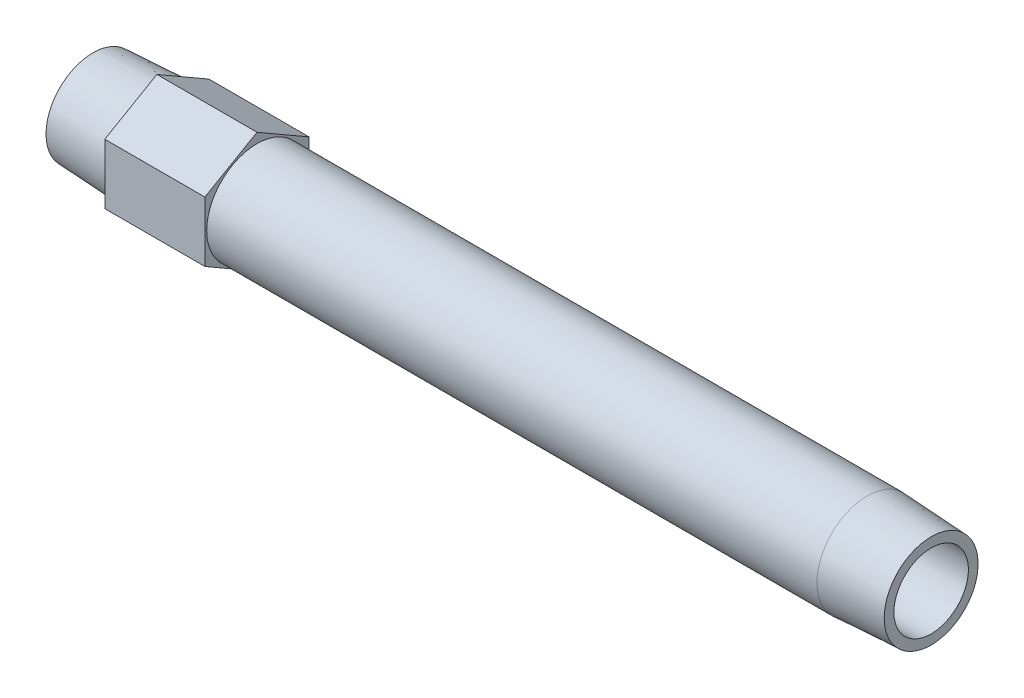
ISO-10303-21;
HEADER;
FILE_DESCRIPTION(('STEP AP214'),'2;1');
FILE_NAME('part.step','',(''),(''),'','','');
FILE_SCHEMA(('AUTOMOTIVE_DESIGN { 1 0 10303 214 1 1 1 1 }'));
ENDSEC;
DATA;
#1=APPLICATION_CONTEXT('core data for automotive mechanical design processes');
#2=APPLICATION_PROTOCOL_DEFINITION('international standard','automotive_design',2000,#1);
#3=PRODUCT_CONTEXT('',#1,'mechanical');
#4=PRODUCT('Part','Part','',(#3));
#5=PRODUCT_RELATED_PRODUCT_CATEGORY('part','',(#4));
#6=PRODUCT_DEFINITION_FORMATION('','',#4);
#7=PRODUCT_DEFINITION_CONTEXT('part definition',#1,'design');
#8=PRODUCT_DEFINITION('design','',#6,#7);
#9=PRODUCT_DEFINITION_SHAPE('','',#8);
#10=(LENGTH_UNIT() NAMED_UNIT(*) SI_UNIT(.MILLI.,.METRE.));
#11=(NAMED_UNIT(*) PLANE_ANGLE_UNIT() SI_UNIT($,.RADIAN.));
#12=(NAMED_UNIT(*) SI_UNIT($,.STERADIAN.) SOLID_ANGLE_UNIT());
#13=UNCERTAINTY_MEASURE_WITH_UNIT(LENGTH_MEASURE(1.E-05),#10,'distance_accuracy_value','');
#14=(GEOMETRIC_REPRESENTATION_CONTEXT(3) GLOBAL_UNCERTAINTY_ASSIGNED_CONTEXT((#13)) GLOBAL_UNIT_ASSIGNED_CONTEXT((#10,
#11,#12)) REPRESENTATION_CONTEXT('',''));
#15=CARTESIAN_POINT('',(0.,0.,0.));
#16=DIRECTION('',(0.,0.,1.));
#17=DIRECTION('',(1.,0.,0.));
#18=AXIS2_PLACEMENT_3D('',#15,#16,#17);
#19=CARTESIAN_POINT('',(0.,0.,-9.95716184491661));
#20=DIRECTION('',(1.,0.,0.));
#21=DIRECTION('',(0.,0.,-1.));
#22=AXIS2_PLACEMENT_3D('',#19,#20,#21);
#23=PLANE('',#22);
#24=CARTESIAN_POINT('',(0.,0.,0.));
#25=DIRECTION('',(-1.,0.,0.));
#26=DIRECTION('',(0.,0.,1.));
#27=AXIS2_PLACEMENT_3D('',#24,#25,#26);
#28=CIRCLE('',#27,9.95716184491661);
#29=CARTESIAN_POINT('',(0.,0.,9.95716184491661));
#30=VERTEX_POINT('',#29);
#31=EDGE_CURVE('E147',#30,#30,#28,.T.);
#32=ORIENTED_EDGE('',*,*,#31,.T.);
#33=EDGE_LOOP('',(#32));
#34=FACE_BOUND('',#33,.T.);
#35=CARTESIAN_POINT('',(0.,0.,0.));
#36=DIRECTION('',(1.,0.,0.));
#37=DIRECTION('',(0.,0.,1.));
#38=AXIS2_PLACEMENT_3D('',#35,#36,#37);
#39=CIRCLE('',#38,7.8994);
#40=CARTESIAN_POINT('',(0.,0.,7.8994));
#41=VERTEX_POINT('',#40);
#42=EDGE_CURVE('E159',#41,#41,#39,.T.);
#43=ORIENTED_EDGE('',*,*,#42,.T.);
#44=EDGE_LOOP('',(#43));
#45=FACE_BOUND('',#44,.T.);
#46=ADVANCED_FACE('F15',(#34,#45),#23,.F.);
#47=CARTESIAN_POINT('',(177.8,0.,-9.95716184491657));
#48=DIRECTION('',(-1.,0.,0.));
#49=DIRECTION('',(0.,0.,1.));
#50=AXIS2_PLACEMENT_3D('',#47,#48,#49);
#51=PLANE('',#50);
#52=CARTESIAN_POINT('',(177.8,0.,0.));
#53=DIRECTION('',(-1.,0.,0.));
#54=DIRECTION('',(0.,0.,1.));
#55=AXIS2_PLACEMENT_3D('',#52,#53,#54);
#56=CIRCLE('',#55,9.95716184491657);
#57=CARTESIAN_POINT('',(177.8,0.,9.95716184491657));
#58=VERTEX_POINT('',#57);
#59=EDGE_CURVE('E150',#58,#58,#56,.T.);
#60=ORIENTED_EDGE('',*,*,#59,.F.);
#61=EDGE_LOOP('',(#60));
#62=FACE_BOUND('',#61,.T.);
#63=CARTESIAN_POINT('',(177.8,0.,0.));
#64=DIRECTION('',(-1.,0.,0.));
#65=DIRECTION('',(0.,0.,1.));
#66=AXIS2_PLACEMENT_3D('',#63,#64,#65);
#67=CIRCLE('',#66,7.8994);
#68=CARTESIAN_POINT('',(177.8,0.,7.8994));
#69=VERTEX_POINT('',#68);
#70=EDGE_CURVE('E156',#69,#69,#67,.F.);
#71=ORIENTED_EDGE('',*,*,#70,.F.);
#72=EDGE_LOOP('',(#71));
#73=FACE_BOUND('',#72,.T.);
#74=ADVANCED_FACE('F178',(#62,#73),#51,.F.);
#75=CARTESIAN_POINT('',(34.798,-6.37914312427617,-11.049));
#76=DIRECTION('',(1.,0.,0.));
#77=DIRECTION('',(0.,1.,0.));
#78=AXIS2_PLACEMENT_3D('',#75,#76,#77);
#79=PLANE('',#78);
#80=DIRECTION('',(0.,0.5,-0.866025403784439));
#81=VECTOR('',#80,1.);
#82=CARTESIAN_POINT('',(34.798,-12.7582862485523,0.));
#83=LINE('',#82,#81);
#84=CARTESIAN_POINT('',(34.798,-12.7582862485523,0.));
#85=VERTEX_POINT('',#84);
#86=CARTESIAN_POINT('',(34.798,-6.37914312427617,-11.049));
#87=VERTEX_POINT('',#86);
#88=EDGE_CURVE('E103',#85,#87,#83,.T.);
#89=ORIENTED_EDGE('',*,*,#88,.T.);
#90=DIRECTION('',(0.,1.,0.));
#91=VECTOR('',#90,1.);
#92=CARTESIAN_POINT('',(34.798,-6.37914312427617,-11.049));
#93=LINE('',#92,#91);
#94=CARTESIAN_POINT('',(34.798,6.37914312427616,-11.049));
#95=VERTEX_POINT('',#94);
#96=EDGE_CURVE('E83',#87,#95,#93,.T.);
#97=ORIENTED_EDGE('',*,*,#96,.T.);
#98=DIRECTION('',(0.,0.5,0.866025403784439));
#99=VECTOR('',#98,1.);
#100=CARTESIAN_POINT('',(34.798,6.37914312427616,-11.049));
#101=LINE('',#100,#99);
#102=CARTESIAN_POINT('',(34.798,12.7582862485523,0.));
#103=VERTEX_POINT('',#102);
#104=EDGE_CURVE('E102',#95,#103,#101,.T.);
#105=ORIENTED_EDGE('',*,*,#104,.T.);
#106=DIRECTION('',(0.,-0.5,0.866025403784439));
#107=VECTOR('',#106,1.);
#108=CARTESIAN_POINT('',(34.798,12.7582862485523,0.));
#109=LINE('',#108,#107);
#110=CARTESIAN_POINT('',(34.798,6.37914312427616,11.049));
#111=VERTEX_POINT('',#110);
#112=EDGE_CURVE('E105',#103,#111,#109,.T.);
#113=ORIENTED_EDGE('',*,*,#112,.T.);
#114=DIRECTION('',(0.,-1.,0.));
#115=VECTOR('',#114,1.);
#116=CARTESIAN_POINT('',(34.798,6.37914312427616,11.049));
#117=LINE('',#116,#115);
#118=CARTESIAN_POINT('',(34.798,-6.37914312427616,11.049));
#119=VERTEX_POINT('',#118);
#120=EDGE_CURVE('E35',#111,#119,#117,.T.);
#121=ORIENTED_EDGE('',*,*,#120,.T.);
#122=DIRECTION('',(0.,-0.5,-0.866025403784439));
#123=VECTOR('',#122,1.);
#124=CARTESIAN_POINT('',(34.798,-6.37914312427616,11.049));
#125=LINE('',#124,#123);
#126=EDGE_CURVE('E30',#119,#85,#125,.T.);
#127=ORIENTED_EDGE('',*,*,#126,.T.);
#128=EDGE_LOOP('',(#89,#97,#105,#113,#121,#127));
#129=FACE_BOUND('',#128,.T.);
#130=CARTESIAN_POINT('',(34.798,0.,0.));
#131=DIRECTION('',(1.,0.,0.));
#132=DIRECTION('',(0.,1.,0.));
#133=AXIS2_PLACEMENT_3D('',#130,#131,#132);
#134=CIRCLE('',#133,10.668);
#135=CARTESIAN_POINT('',(34.798,10.668,0.));
#136=VERTEX_POINT('',#135);
#137=EDGE_CURVE('E89',#136,#136,#134,.F.);
#138=ORIENTED_EDGE('',*,*,#137,.T.);
#139=EDGE_LOOP('',(#138));
#140=FACE_BOUND('',#139,.T.);
#141=ADVANCED_FACE('F124',(#129,#140),#79,.T.);
#142=CARTESIAN_POINT('',(13.5636,-6.37914312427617,-11.049));
#143=DIRECTION('',(1.,0.,0.));
#144=DIRECTION('',(0.,1.,0.));
#145=AXIS2_PLACEMENT_3D('',#142,#143,#144);
#146=PLANE('',#145);
#147=DIRECTION('',(0.,0.5,-0.866025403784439));
#148=VECTOR('',#147,1.);
#149=CARTESIAN_POINT('',(13.5636,-12.7582862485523,0.));
#150=LINE('',#149,#148);
#151=CARTESIAN_POINT('',(13.5636,-12.7582862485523,0.));
#152=VERTEX_POINT('',#151);
#153=CARTESIAN_POINT('',(13.5636,-6.37914312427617,-11.049));
#154=VERTEX_POINT('',#153);
#155=EDGE_CURVE('E73',#152,#154,#150,.T.);
#156=ORIENTED_EDGE('',*,*,#155,.F.);
#157=DIRECTION('',(0.,-0.5,-0.866025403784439));
#158=VECTOR('',#157,1.);
#159=CARTESIAN_POINT('',(13.5636,-6.37914312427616,11.049));
#160=LINE('',#159,#158);
#161=CARTESIAN_POINT('',(13.5636,-6.37914312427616,11.049));
#162=VERTEX_POINT('',#161);
#163=EDGE_CURVE('E99',#162,#152,#160,.T.);
#164=ORIENTED_EDGE('',*,*,#163,.F.);
#165=DIRECTION('',(0.,-1.,0.));
#166=VECTOR('',#165,1.);
#167=CARTESIAN_POINT('',(13.5636,6.37914312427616,11.049));
#168=LINE('',#167,#166);
#169=CARTESIAN_POINT('',(13.5636,6.37914312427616,11.049));
#170=VERTEX_POINT('',#169);
#171=EDGE_CURVE('E133',#170,#162,#168,.T.);
#172=ORIENTED_EDGE('',*,*,#171,.F.);
#173=DIRECTION('',(0.,-0.5,0.866025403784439));
#174=VECTOR('',#173,1.);
#175=CARTESIAN_POINT('',(13.5636,12.7582862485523,0.));
#176=LINE('',#175,#174);
#177=CARTESIAN_POINT('',(13.5636,12.7582862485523,0.));
#178=VERTEX_POINT('',#177);
#179=EDGE_CURVE('E129',#178,#170,#176,.T.);
#180=ORIENTED_EDGE('',*,*,#179,.F.);
#181=DIRECTION('',(0.,0.5,0.866025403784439));
#182=VECTOR('',#181,1.);
#183=CARTESIAN_POINT('',(13.5636,6.37914312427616,-11.049));
#184=LINE('',#183,#182);
#185=CARTESIAN_POINT('',(13.5636,6.37914312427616,-11.049));
#186=VERTEX_POINT('',#185);
#187=EDGE_CURVE('E75',#186,#178,#184,.T.);
#188=ORIENTED_EDGE('',*,*,#187,.F.);
#189=DIRECTION('',(0.,1.,0.));
#190=VECTOR('',#189,1.);
#191=CARTESIAN_POINT('',(13.5636,-6.37914312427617,-11.049));
#192=LINE('',#191,#190);
#193=EDGE_CURVE('E68',#154,#186,#192,.T.);
#194=ORIENTED_EDGE('',*,*,#193,.F.);
#195=EDGE_LOOP('',(#156,#164,#172,#180,#188,#194));
#196=FACE_BOUND('',#195,.T.);
#197=CARTESIAN_POINT('',(13.5636,0.,0.));
#198=DIRECTION('',(-1.,0.,0.));
#199=DIRECTION('',(0.,0.,1.));
#200=AXIS2_PLACEMENT_3D('',#197,#198,#199);
#201=CIRCLE('',#200,10.668);
#202=CARTESIAN_POINT('',(13.5636,0.,10.668));
#203=VERTEX_POINT('',#202);
#204=EDGE_CURVE('E95',#203,#203,#201,.T.);
#205=ORIENTED_EDGE('',*,*,#204,.F.);
#206=EDGE_LOOP('',(#205));
#207=FACE_BOUND('',#206,.T.);
#208=ADVANCED_FACE('F69',(#196,#207),#146,.F.);
#209=CARTESIAN_POINT('',(34.798,-12.7582862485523,0.));
#210=DIRECTION('',(0.,0.866025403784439,0.5));
#211=DIRECTION('',(0.,-0.5,0.866025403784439));
#212=AXIS2_PLACEMENT_3D('',#209,#210,#211);
#213=PLANE('',#212);
#214=ORIENTED_EDGE('',*,*,#155,.T.);
#215=DIRECTION('',(-1.,0.,0.));
#216=VECTOR('',#215,1.);
#217=CARTESIAN_POINT('',(34.798,-6.37914312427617,-11.049));
#218=LINE('',#217,#216);
#219=EDGE_CURVE('E10',#87,#154,#218,.T.);
#220=ORIENTED_EDGE('',*,*,#219,.F.);
#221=ORIENTED_EDGE('',*,*,#88,.F.);
#222=DIRECTION('',(-1.,0.,0.));
#223=VECTOR('',#222,1.);
#224=CARTESIAN_POINT('',(34.798,-12.7582862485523,0.));
#225=LINE('',#224,#223);
#226=EDGE_CURVE('E87',#85,#152,#225,.T.);
#227=ORIENTED_EDGE('',*,*,#226,.T.);
#228=EDGE_LOOP('',(#214,#220,#221,#227));
#229=FACE_BOUND('',#228,.T.);
#230=ADVANCED_FACE('F17',(#229),#213,.F.);
#231=CARTESIAN_POINT('',(34.798,-6.37914312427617,-11.049));
#232=DIRECTION('',(0.,0.,1.));
#233=DIRECTION('',(1.,0.,0.));
#234=AXIS2_PLACEMENT_3D('',#231,#232,#233);
#235=PLANE('',#234);
#236=ORIENTED_EDGE('',*,*,#193,.T.);
#237=DIRECTION('',(-1.,0.,0.));
#238=VECTOR('',#237,1.);
#239=CARTESIAN_POINT('',(34.798,6.37914312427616,-11.049));
#240=LINE('',#239,#238);
#241=EDGE_CURVE('E23',#95,#186,#240,.T.);
#242=ORIENTED_EDGE('',*,*,#241,.F.);
#243=ORIENTED_EDGE('',*,*,#96,.F.);
#244=ORIENTED_EDGE('',*,*,#219,.T.);
#245=EDGE_LOOP('',(#236,#242,#243,#244));
#246=FACE_BOUND('',#245,.T.);
#247=ADVANCED_FACE('F82',(#246),#235,.F.);
#248=CARTESIAN_POINT('',(34.798,6.37914312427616,-11.049));
#249=DIRECTION('',(0.,-0.866025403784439,0.5));
#250=DIRECTION('',(0.,-0.5,-0.866025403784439));
#251=AXIS2_PLACEMENT_3D('',#248,#249,#250);
#252=PLANE('',#251);
#253=ORIENTED_EDGE('',*,*,#187,.T.);
#254=DIRECTION('',(-1.,0.,0.));
#255=VECTOR('',#254,1.);
#256=CARTESIAN_POINT('',(34.798,12.7582862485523,0.));
#257=LINE('',#256,#255);
#258=EDGE_CURVE('E117',#103,#178,#257,.T.);
#259=ORIENTED_EDGE('',*,*,#258,.F.);
#260=ORIENTED_EDGE('',*,*,#104,.F.);
#261=ORIENTED_EDGE('',*,*,#241,.T.);
#262=EDGE_LOOP('',(#253,#259,#260,#261));
#263=FACE_BOUND('',#262,.T.);
#264=ADVANCED_FACE('F121',(#263),#252,.F.);
#265=CARTESIAN_POINT('',(34.798,12.7582862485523,0.));
#266=DIRECTION('',(0.,-0.866025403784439,-0.5));
#267=DIRECTION('',(0.,0.5,-0.866025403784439));
#268=AXIS2_PLACEMENT_3D('',#265,#266,#267);
#269=PLANE('',#268);
#270=ORIENTED_EDGE('',*,*,#179,.T.);
#271=DIRECTION('',(-1.,0.,0.));
#272=VECTOR('',#271,1.);
#273=CARTESIAN_POINT('',(34.798,6.37914312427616,11.049));
#274=LINE('',#273,#272);
#275=EDGE_CURVE('E114',#111,#170,#274,.T.);
#276=ORIENTED_EDGE('',*,*,#275,.F.);
#277=ORIENTED_EDGE('',*,*,#112,.F.);
#278=ORIENTED_EDGE('',*,*,#258,.T.);
#279=EDGE_LOOP('',(#270,#276,#277,#278));
#280=FACE_BOUND('',#279,.T.);
#281=ADVANCED_FACE('F128',(#280),#269,.F.);
#282=CARTESIAN_POINT('',(34.798,6.37914312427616,11.049));
#283=DIRECTION('',(0.,0.,-1.));
#284=DIRECTION('',(-1.,0.,0.));
#285=AXIS2_PLACEMENT_3D('',#282,#283,#284);
#286=PLANE('',#285);
#287=ORIENTED_EDGE('',*,*,#171,.T.);
#288=DIRECTION('',(-1.,0.,0.));
#289=VECTOR('',#288,1.);
#290=CARTESIAN_POINT('',(34.798,-6.37914312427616,11.049));
#291=LINE('',#290,#289);
#292=EDGE_CURVE('E111',#119,#162,#291,.T.);
#293=ORIENTED_EDGE('',*,*,#292,.F.);
#294=ORIENTED_EDGE('',*,*,#120,.F.);
#295=ORIENTED_EDGE('',*,*,#275,.T.);
#296=EDGE_LOOP('',(#287,#293,#294,#295));
#297=FACE_BOUND('',#296,.T.);
#298=ADVANCED_FACE('F132',(#297),#286,.F.);
#299=CARTESIAN_POINT('',(34.798,-6.37914312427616,11.049));
#300=DIRECTION('',(0.,0.866025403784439,-0.5));
#301=DIRECTION('',(0.,0.5,0.866025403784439));
#302=AXIS2_PLACEMENT_3D('',#299,#300,#301);
#303=PLANE('',#302);
#304=ORIENTED_EDGE('',*,*,#163,.T.);
#305=ORIENTED_EDGE('',*,*,#226,.F.);
#306=ORIENTED_EDGE('',*,*,#126,.F.);
#307=ORIENTED_EDGE('',*,*,#292,.T.);
#308=EDGE_LOOP('',(#304,#305,#306,#307));
#309=FACE_BOUND('',#308,.T.);
#310=ADVANCED_FACE('F135',(#309),#303,.F.);
#311=CARTESIAN_POINT('',(13.5636,0.,0.));
#312=DIRECTION('',(1.,0.,0.));
#313=DIRECTION('',(0.,0.,-1.));
#314=AXIS2_PLACEMENT_3D('',#311,#312,#313);
#315=CONICAL_SURFACE('',#314,10.668,0.0523598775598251);
#316=ORIENTED_EDGE('',*,*,#31,.F.);
#317=EDGE_LOOP('',(#316));
#318=FACE_BOUND('',#317,.T.);
#319=ORIENTED_EDGE('',*,*,#204,.T.);
#320=EDGE_LOOP('',(#319));
#321=FACE_BOUND('',#320,.T.);
#322=ADVANCED_FACE('F187',(#318,#321),#315,.T.);
#323=CARTESIAN_POINT('',(-60.,0.,0.));
#324=DIRECTION('',(-1.,0.,0.));
#325=DIRECTION('',(0.,0.,1.));
#326=AXIS2_PLACEMENT_3D('',#323,#324,#325);
#327=CYLINDRICAL_SURFACE('',#326,10.668);
#328=ORIENTED_EDGE('',*,*,#137,.F.);
#329=EDGE_LOOP('',(#328));
#330=FACE_BOUND('',#329,.T.);
#331=CARTESIAN_POINT('',(164.2364,0.,0.));
#332=DIRECTION('',(-1.,0.,0.));
#333=DIRECTION('',(0.,0.,1.));
#334=AXIS2_PLACEMENT_3D('',#331,#332,#333);
#335=CIRCLE('',#334,10.668);
#336=CARTESIAN_POINT('',(164.2364,0.,10.668));
#337=VERTEX_POINT('',#336);
#338=EDGE_CURVE('E153',#337,#337,#335,.T.);
#339=ORIENTED_EDGE('',*,*,#338,.T.);
#340=EDGE_LOOP('',(#339));
#341=FACE_BOUND('',#340,.T.);
#342=ADVANCED_FACE('F174',(#330,#341),#327,.T.);
#343=CARTESIAN_POINT('',(177.8,0.,0.));
#344=DIRECTION('',(-1.,0.,0.));
#345=DIRECTION('',(0.,0.,1.));
#346=AXIS2_PLACEMENT_3D('',#343,#344,#345);
#347=CONICAL_SURFACE('',#346,9.95716184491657,0.052359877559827);
#348=ORIENTED_EDGE('',*,*,#338,.F.);
#349=EDGE_LOOP('',(#348));
#350=FACE_BOUND('',#349,.T.);
#351=ORIENTED_EDGE('',*,*,#59,.T.);
#352=EDGE_LOOP('',(#351));
#353=FACE_BOUND('',#352,.T.);
#354=ADVANCED_FACE('F167',(#350,#353),#347,.T.);
#355=CARTESIAN_POINT('',(180.975846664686,0.,0.));
#356=DIRECTION('',(-1.,0.,0.));
#357=DIRECTION('',(0.,0.,1.));
#358=AXIS2_PLACEMENT_3D('',#355,#356,#357);
#359=CYLINDRICAL_SURFACE('',#358,7.8994);
#360=ORIENTED_EDGE('',*,*,#70,.T.);
#361=EDGE_LOOP('',(#360));
#362=FACE_BOUND('',#361,.T.);
#363=ORIENTED_EDGE('',*,*,#42,.F.);
#364=EDGE_LOOP('',(#363));
#365=FACE_BOUND('',#364,.T.);
#366=ADVANCED_FACE('F165',(#362,#365),#359,.F.);
#367=CLOSED_SHELL('',(#46,#74,#141,#208,#230,#247,#264,#281,#298,#310,#322,#342,#354,#366));
#368=MANIFOLD_SOLID_BREP('B1',#367);
#369=ADVANCED_BREP_SHAPE_REPRESENTATION('',(#18,#368),#14);
#370=SHAPE_DEFINITION_REPRESENTATION(#9,#369);
ENDSEC;
END-ISO-10303-21;
